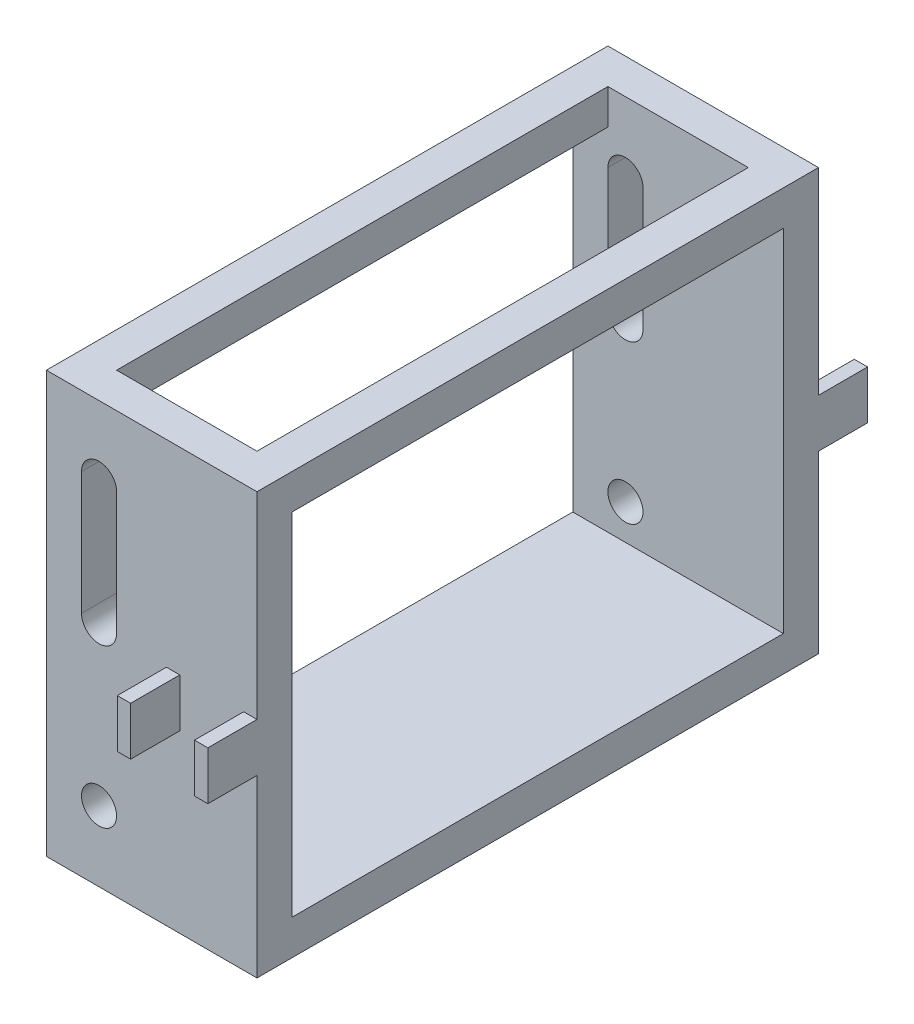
ISO-10303-21;
HEADER;
FILE_DESCRIPTION(('STEP AP214'),'2;1');
FILE_NAME('part.step','',(''),(''),'','','');
FILE_SCHEMA(('AUTOMOTIVE_DESIGN { 1 0 10303 214 1 1 1 1 }'));
ENDSEC;
DATA;
#1=APPLICATION_CONTEXT('core data for automotive mechanical design processes');
#2=APPLICATION_PROTOCOL_DEFINITION('international standard','automotive_design',2000,#1);
#3=PRODUCT_CONTEXT('',#1,'mechanical');
#4=PRODUCT('Part','Part','',(#3));
#5=PRODUCT_RELATED_PRODUCT_CATEGORY('part','',(#4));
#6=PRODUCT_DEFINITION_FORMATION('','',#4);
#7=PRODUCT_DEFINITION_CONTEXT('part definition',#1,'design');
#8=PRODUCT_DEFINITION('design','',#6,#7);
#9=PRODUCT_DEFINITION_SHAPE('','',#8);
#10=(LENGTH_UNIT() NAMED_UNIT(*) SI_UNIT(.MILLI.,.METRE.));
#11=(NAMED_UNIT(*) PLANE_ANGLE_UNIT() SI_UNIT($,.RADIAN.));
#12=(NAMED_UNIT(*) SI_UNIT($,.STERADIAN.) SOLID_ANGLE_UNIT());
#13=UNCERTAINTY_MEASURE_WITH_UNIT(LENGTH_MEASURE(1.E-05),#10,'distance_accuracy_value','');
#14=(GEOMETRIC_REPRESENTATION_CONTEXT(3) GLOBAL_UNCERTAINTY_ASSIGNED_CONTEXT((#13)) GLOBAL_UNIT_ASSIGNED_CONTEXT((#10,
#11,#12)) REPRESENTATION_CONTEXT('',''));
#15=CARTESIAN_POINT('',(0.,0.,0.));
#16=DIRECTION('',(0.,0.,1.));
#17=DIRECTION('',(1.,0.,0.));
#18=AXIS2_PLACEMENT_3D('',#15,#16,#17);
#19=CARTESIAN_POINT('',(0.,12.7,0.));
#20=DIRECTION('',(0.,0.,-1.));
#21=DIRECTION('',(-1.,0.,0.));
#22=AXIS2_PLACEMENT_3D('',#19,#20,#21);
#23=PLANE('',#22);
#24=DIRECTION('',(-1.,0.,0.));
#25=VECTOR('',#24,1.);
#26=CARTESIAN_POINT('',(71.374,81.026,0.));
#27=LINE('',#26,#25);
#28=CARTESIAN_POINT('',(76.2,81.026,0.));
#29=VERTEX_POINT('',#28);
#30=CARTESIAN_POINT('',(71.374,81.026,0.));
#31=VERTEX_POINT('',#30);
#32=EDGE_CURVE('E415',#29,#31,#27,.T.);
#33=ORIENTED_EDGE('',*,*,#32,.F.);
#34=DIRECTION('',(0.,-1.,0.));
#35=VECTOR('',#34,1.);
#36=CARTESIAN_POINT('',(76.2,12.7,0.));
#37=LINE('',#36,#35);
#38=CARTESIAN_POINT('',(76.2,152.4,0.));
#39=VERTEX_POINT('',#38);
#40=EDGE_CURVE('E655',#39,#29,#37,.T.);
#41=ORIENTED_EDGE('',*,*,#40,.F.);
#42=DIRECTION('',(1.,0.,0.));
#43=VECTOR('',#42,1.);
#44=CARTESIAN_POINT('',(0.,152.4,0.));
#45=LINE('',#44,#43);
#46=CARTESIAN_POINT('',(0.,152.4,0.));
#47=VERTEX_POINT('',#46);
#48=EDGE_CURVE('E575',#47,#39,#45,.T.);
#49=ORIENTED_EDGE('',*,*,#48,.F.);
#50=DIRECTION('',(0.,-1.,0.));
#51=VECTOR('',#50,1.);
#52=CARTESIAN_POINT('',(0.,12.7,0.));
#53=LINE('',#52,#51);
#54=CARTESIAN_POINT('',(0.,0.,0.));
#55=VERTEX_POINT('',#54);
#56=EDGE_CURVE('E659',#47,#55,#53,.T.);
#57=ORIENTED_EDGE('',*,*,#56,.T.);
#58=DIRECTION('',(1.,0.,0.));
#59=VECTOR('',#58,1.);
#60=CARTESIAN_POINT('',(0.,0.,0.));
#61=LINE('',#60,#59);
#62=CARTESIAN_POINT('',(76.2,0.,0.));
#63=VERTEX_POINT('',#62);
#64=EDGE_CURVE('E636',#55,#63,#61,.T.);
#65=ORIENTED_EDGE('',*,*,#64,.T.);
#66=CARTESIAN_POINT('',(76.2,63.5,0.));
#67=VERTEX_POINT('',#66);
#68=EDGE_CURVE('E654',#67,#63,#37,.T.);
#69=ORIENTED_EDGE('',*,*,#68,.F.);
#70=DIRECTION('',(1.,0.,0.));
#71=VECTOR('',#70,1.);
#72=CARTESIAN_POINT('',(71.374,63.5,0.));
#73=LINE('',#72,#71);
#74=CARTESIAN_POINT('',(71.374,63.5,0.));
#75=VERTEX_POINT('',#74);
#76=EDGE_CURVE('E428',#75,#67,#73,.T.);
#77=ORIENTED_EDGE('',*,*,#76,.F.);
#78=DIRECTION('',(0.,-1.,0.));
#79=VECTOR('',#78,1.);
#80=CARTESIAN_POINT('',(71.374,81.026,0.));
#81=LINE('',#80,#79);
#82=EDGE_CURVE('E409',#31,#75,#81,.T.);
#83=ORIENTED_EDGE('',*,*,#82,.F.);
#84=EDGE_LOOP('',(#33,#41,#49,#57,#65,#69,#77,#83));
#85=FACE_BOUND('',#84,.T.);
#86=CARTESIAN_POINT('',(19.05,25.4,0.));
#87=DIRECTION('',(0.,0.,1.));
#88=DIRECTION('',(1.,0.,0.));
#89=AXIS2_PLACEMENT_3D('',#86,#87,#88);
#90=CIRCLE('',#89,6.35);
#91=CARTESIAN_POINT('',(25.4,25.4,0.));
#92=VERTEX_POINT('',#91);
#93=EDGE_CURVE('E456',#92,#92,#90,.T.);
#94=ORIENTED_EDGE('',*,*,#93,.F.);
#95=EDGE_LOOP('',(#94));
#96=FACE_BOUND('',#95,.T.);
#97=DIRECTION('',(0.,-1.,0.));
#98=VECTOR('',#97,1.);
#99=CARTESIAN_POINT('',(12.7,127.,0.));
#100=LINE('',#99,#98);
#101=CARTESIAN_POINT('',(12.7,127.,0.));
#102=VERTEX_POINT('',#101);
#103=CARTESIAN_POINT('',(12.7,82.55,0.));
#104=VERTEX_POINT('',#103);
#105=EDGE_CURVE('E481',#102,#104,#100,.T.);
#106=ORIENTED_EDGE('',*,*,#105,.F.);
#107=CARTESIAN_POINT('',(19.05,127.,0.));
#108=DIRECTION('',(0.,0.,1.));
#109=DIRECTION('',(1.,0.,0.));
#110=AXIS2_PLACEMENT_3D('',#107,#108,#109);
#111=CIRCLE('',#110,6.35);
#112=CARTESIAN_POINT('',(25.4,127.,0.));
#113=VERTEX_POINT('',#112);
#114=EDGE_CURVE('E450',#113,#102,#111,.T.);
#115=ORIENTED_EDGE('',*,*,#114,.F.);
#116=DIRECTION('',(0.,1.,0.));
#117=VECTOR('',#116,1.);
#118=CARTESIAN_POINT('',(25.4,127.,0.));
#119=LINE('',#118,#117);
#120=CARTESIAN_POINT('',(25.4,82.55,0.));
#121=VERTEX_POINT('',#120);
#122=EDGE_CURVE('E466',#121,#113,#119,.T.);
#123=ORIENTED_EDGE('',*,*,#122,.F.);
#124=CARTESIAN_POINT('',(19.05,82.55,0.));
#125=DIRECTION('',(0.,0.,1.));
#126=DIRECTION('',(1.,0.,0.));
#127=AXIS2_PLACEMENT_3D('',#124,#125,#126);
#128=CIRCLE('',#127,6.35);
#129=EDGE_CURVE('E485',#104,#121,#128,.T.);
#130=ORIENTED_EDGE('',*,*,#129,.F.);
#131=EDGE_LOOP('',(#106,#115,#123,#130));
#132=FACE_BOUND('',#131,.T.);
#133=DIRECTION('',(0.,1.,0.));
#134=VECTOR('',#133,1.);
#135=CARTESIAN_POINT('',(48.26,81.026,0.));
#136=LINE('',#135,#134);
#137=CARTESIAN_POINT('',(48.26,63.5,0.));
#138=VERTEX_POINT('',#137);
#139=CARTESIAN_POINT('',(48.26,81.026,0.));
#140=VERTEX_POINT('',#139);
#141=EDGE_CURVE('E364',#138,#140,#136,.T.);
#142=ORIENTED_EDGE('',*,*,#141,.F.);
#143=DIRECTION('',(1.,0.,0.));
#144=VECTOR('',#143,1.);
#145=CARTESIAN_POINT('',(48.26,63.5,0.));
#146=LINE('',#145,#144);
#147=CARTESIAN_POINT('',(43.434,63.5,0.));
#148=VERTEX_POINT('',#147);
#149=EDGE_CURVE('E370',#148,#138,#146,.T.);
#150=ORIENTED_EDGE('',*,*,#149,.F.);
#151=DIRECTION('',(0.,-1.,0.));
#152=VECTOR('',#151,1.);
#153=CARTESIAN_POINT('',(43.434,81.026,0.));
#154=LINE('',#153,#152);
#155=CARTESIAN_POINT('',(43.434,81.026,0.));
#156=VERTEX_POINT('',#155);
#157=EDGE_CURVE('E387',#156,#148,#154,.T.);
#158=ORIENTED_EDGE('',*,*,#157,.F.);
#159=DIRECTION('',(-1.,0.,0.));
#160=VECTOR('',#159,1.);
#161=CARTESIAN_POINT('',(48.26,81.026,0.));
#162=LINE('',#161,#160);
#163=EDGE_CURVE('E383',#140,#156,#162,.T.);
#164=ORIENTED_EDGE('',*,*,#163,.F.);
#165=EDGE_LOOP('',(#142,#150,#158,#164));
#166=FACE_BOUND('',#165,.T.);
#167=ADVANCED_FACE('F39',(#85,#96,#132,#166),#23,.F.);
#168=CARTESIAN_POINT('',(0.,12.7,0.));
#169=DIRECTION('',(0.,-1.,0.));
#170=DIRECTION('',(0.,0.,-1.));
#171=AXIS2_PLACEMENT_3D('',#168,#169,#170);
#172=PLANE('',#171);
#173=DIRECTION('',(-1.,0.,0.));
#174=VECTOR('',#173,1.);
#175=CARTESIAN_POINT('',(76.2,12.7,-12.7));
#176=LINE('',#175,#174);
#177=CARTESIAN_POINT('',(76.2,12.7,-12.7));
#178=VERTEX_POINT('',#177);
#179=CARTESIAN_POINT('',(0.,12.7,-12.7));
#180=VERTEX_POINT('',#179);
#181=EDGE_CURVE('E593',#178,#180,#176,.T.);
#182=ORIENTED_EDGE('',*,*,#181,.F.);
#183=DIRECTION('',(0.,0.,-1.));
#184=VECTOR('',#183,1.);
#185=CARTESIAN_POINT('',(76.2,12.7,0.));
#186=LINE('',#185,#184);
#187=CARTESIAN_POINT('',(76.2,12.7,-190.5));
#188=VERTEX_POINT('',#187);
#189=EDGE_CURVE('E628',#178,#188,#186,.T.);
#190=ORIENTED_EDGE('',*,*,#189,.T.);
#191=DIRECTION('',(1.,0.,0.));
#192=VECTOR('',#191,1.);
#193=CARTESIAN_POINT('',(0.,12.7,-190.5));
#194=LINE('',#193,#192);
#195=CARTESIAN_POINT('',(0.,12.7,-190.5));
#196=VERTEX_POINT('',#195);
#197=EDGE_CURVE('E609',#196,#188,#194,.T.);
#198=ORIENTED_EDGE('',*,*,#197,.F.);
#199=DIRECTION('',(0.,0.,1.));
#200=VECTOR('',#199,1.);
#201=CARTESIAN_POINT('',(0.,12.7,0.));
#202=LINE('',#201,#200);
#203=EDGE_CURVE('E625',#196,#180,#202,.T.);
#204=ORIENTED_EDGE('',*,*,#203,.T.);
#205=EDGE_LOOP('',(#182,#190,#198,#204));
#206=FACE_BOUND('',#205,.T.);
#207=ADVANCED_FACE('F750',(#206),#172,.F.);
#208=CARTESIAN_POINT('',(0.,12.7,0.));
#209=DIRECTION('',(1.,0.,0.));
#210=DIRECTION('',(0.,0.,-1.));
#211=AXIS2_PLACEMENT_3D('',#208,#209,#210);
#212=PLANE('',#211);
#213=DIRECTION('',(0.,-1.,0.));
#214=VECTOR('',#213,1.);
#215=CARTESIAN_POINT('',(0.,139.7,-190.5));
#216=LINE('',#215,#214);
#217=CARTESIAN_POINT('',(0.,139.7,-190.5));
#218=VERTEX_POINT('',#217);
#219=EDGE_CURVE('E620',#218,#196,#216,.T.);
#220=ORIENTED_EDGE('',*,*,#219,.F.);
#221=DIRECTION('',(0.,0.,1.));
#222=VECTOR('',#221,1.);
#223=CARTESIAN_POINT('',(0.,139.7,-203.2));
#224=LINE('',#223,#222);
#225=CARTESIAN_POINT('',(0.,139.7,-12.7));
#226=VERTEX_POINT('',#225);
#227=EDGE_CURVE('E565',#218,#226,#224,.T.);
#228=ORIENTED_EDGE('',*,*,#227,.T.);
#229=DIRECTION('',(0.,-1.,0.));
#230=VECTOR('',#229,1.);
#231=CARTESIAN_POINT('',(0.,139.7,-12.7));
#232=LINE('',#231,#230);
#233=EDGE_CURVE('E597',#226,#180,#232,.T.);
#234=ORIENTED_EDGE('',*,*,#233,.T.);
#235=ORIENTED_EDGE('',*,*,#203,.F.);
#236=EDGE_LOOP('',(#220,#228,#234,#235));
#237=FACE_BOUND('',#236,.T.);
#238=DIRECTION('',(0.,0.,1.));
#239=VECTOR('',#238,1.);
#240=CARTESIAN_POINT('',(0.,0.,0.));
#241=LINE('',#240,#239);
#242=CARTESIAN_POINT('',(0.,0.,-203.2));
#243=VERTEX_POINT('',#242);
#244=EDGE_CURVE('E624',#243,#55,#241,.T.);
#245=ORIENTED_EDGE('',*,*,#244,.T.);
#246=ORIENTED_EDGE('',*,*,#56,.F.);
#247=DIRECTION('',(0.,0.,1.));
#248=VECTOR('',#247,1.);
#249=CARTESIAN_POINT('',(0.,152.4,-203.2));
#250=LINE('',#249,#248);
#251=CARTESIAN_POINT('',(0.,152.4,-203.2));
#252=VERTEX_POINT('',#251);
#253=EDGE_CURVE('E570',#252,#47,#250,.T.);
#254=ORIENTED_EDGE('',*,*,#253,.F.);
#255=DIRECTION('',(0.,-1.,0.));
#256=VECTOR('',#255,1.);
#257=CARTESIAN_POINT('',(0.,12.7,-203.2));
#258=LINE('',#257,#256);
#259=EDGE_CURVE('E632',#252,#243,#258,.T.);
#260=ORIENTED_EDGE('',*,*,#259,.T.);
#261=EDGE_LOOP('',(#245,#246,#254,#260));
#262=FACE_BOUND('',#261,.T.);
#263=ADVANCED_FACE('F41',(#237,#262),#212,.F.);
#264=CARTESIAN_POINT('',(76.2,12.7,0.));
#265=DIRECTION('',(-1.,0.,0.));
#266=DIRECTION('',(0.,0.,1.));
#267=AXIS2_PLACEMENT_3D('',#264,#265,#266);
#268=PLANE('',#267);
#269=DIRECTION('',(0.,-1.,0.));
#270=VECTOR('',#269,1.);
#271=CARTESIAN_POINT('',(76.2,12.7,-203.2));
#272=LINE('',#271,#270);
#273=CARTESIAN_POINT('',(76.2,152.4,-203.2));
#274=VERTEX_POINT('',#273);
#275=CARTESIAN_POINT('',(76.2,81.026,-203.2));
#276=VERTEX_POINT('',#275);
#277=EDGE_CURVE('E650',#274,#276,#272,.T.);
#278=ORIENTED_EDGE('',*,*,#277,.F.);
#279=DIRECTION('',(0.,0.,-1.));
#280=VECTOR('',#279,1.);
#281=CARTESIAN_POINT('',(76.2,152.4,0.));
#282=LINE('',#281,#280);
#283=EDGE_CURVE('E579',#39,#274,#282,.T.);
#284=ORIENTED_EDGE('',*,*,#283,.F.);
#285=ORIENTED_EDGE('',*,*,#40,.T.);
#286=DIRECTION('',(0.,0.,-1.));
#287=VECTOR('',#286,1.);
#288=CARTESIAN_POINT('',(76.2,81.026,17.78));
#289=LINE('',#288,#287);
#290=CARTESIAN_POINT('',(76.2,81.026,17.78));
#291=VERTEX_POINT('',#290);
#292=EDGE_CURVE('E438',#291,#29,#289,.T.);
#293=ORIENTED_EDGE('',*,*,#292,.F.);
#294=DIRECTION('',(0.,1.,0.));
#295=VECTOR('',#294,1.);
#296=CARTESIAN_POINT('',(76.2,81.026,17.78));
#297=LINE('',#296,#295);
#298=CARTESIAN_POINT('',(76.2,63.5,17.78));
#299=VERTEX_POINT('',#298);
#300=EDGE_CURVE('E418',#299,#291,#297,.T.);
#301=ORIENTED_EDGE('',*,*,#300,.F.);
#302=DIRECTION('',(0.,0.,-1.));
#303=VECTOR('',#302,1.);
#304=CARTESIAN_POINT('',(76.2,63.5,17.78));
#305=LINE('',#304,#303);
#306=EDGE_CURVE('E442',#299,#67,#305,.T.);
#307=ORIENTED_EDGE('',*,*,#306,.T.);
#308=ORIENTED_EDGE('',*,*,#68,.T.);
#309=DIRECTION('',(0.,0.,-1.));
#310=VECTOR('',#309,1.);
#311=CARTESIAN_POINT('',(76.2,0.,0.));
#312=LINE('',#311,#310);
#313=CARTESIAN_POINT('',(76.2,0.,-203.2));
#314=VERTEX_POINT('',#313);
#315=EDGE_CURVE('E640',#63,#314,#312,.T.);
#316=ORIENTED_EDGE('',*,*,#315,.T.);
#317=CARTESIAN_POINT('',(76.2,63.5,-203.2));
#318=VERTEX_POINT('',#317);
#319=EDGE_CURVE('E649',#318,#314,#272,.T.);
#320=ORIENTED_EDGE('',*,*,#319,.F.);
#321=DIRECTION('',(0.,0.,1.));
#322=VECTOR('',#321,1.);
#323=CARTESIAN_POINT('',(76.2,63.5,-220.98));
#324=LINE('',#323,#322);
#325=CARTESIAN_POINT('',(76.2,63.5,-220.98));
#326=VERTEX_POINT('',#325);
#327=EDGE_CURVE('E355',#326,#318,#324,.T.);
#328=ORIENTED_EDGE('',*,*,#327,.F.);
#329=DIRECTION('',(0.,1.,0.));
#330=VECTOR('',#329,1.);
#331=CARTESIAN_POINT('',(76.2,81.026,-220.98));
#332=LINE('',#331,#330);
#333=CARTESIAN_POINT('',(76.2,81.026,-220.98));
#334=VERTEX_POINT('',#333);
#335=EDGE_CURVE('E335',#326,#334,#332,.T.);
#336=ORIENTED_EDGE('',*,*,#335,.T.);
#337=DIRECTION('',(0.,0.,1.));
#338=VECTOR('',#337,1.);
#339=CARTESIAN_POINT('',(76.2,81.026,-220.98));
#340=LINE('',#339,#338);
#341=EDGE_CURVE('E358',#334,#276,#340,.T.);
#342=ORIENTED_EDGE('',*,*,#341,.T.);
#343=EDGE_LOOP('',(#278,#284,#285,#293,#301,#307,#308,#316,#320,#328,#336,#342));
#344=FACE_BOUND('',#343,.T.);
#345=DIRECTION('',(0.,0.,-1.));
#346=VECTOR('',#345,1.);
#347=CARTESIAN_POINT('',(76.2,139.7,0.));
#348=LINE('',#347,#346);
#349=CARTESIAN_POINT('',(76.2,139.7,-12.7));
#350=VERTEX_POINT('',#349);
#351=CARTESIAN_POINT('',(76.2,139.7,-190.5));
#352=VERTEX_POINT('',#351);
#353=EDGE_CURVE('E571',#350,#352,#348,.T.);
#354=ORIENTED_EDGE('',*,*,#353,.T.);
#355=DIRECTION('',(0.,-1.,0.));
#356=VECTOR('',#355,1.);
#357=CARTESIAN_POINT('',(76.2,139.7,-190.5));
#358=LINE('',#357,#356);
#359=EDGE_CURVE('E613',#352,#188,#358,.T.);
#360=ORIENTED_EDGE('',*,*,#359,.T.);
#361=ORIENTED_EDGE('',*,*,#189,.F.);
#362=DIRECTION('',(0.,-1.,0.));
#363=VECTOR('',#362,1.);
#364=CARTESIAN_POINT('',(76.2,139.7,-12.7));
#365=LINE('',#364,#363);
#366=EDGE_CURVE('E605',#350,#178,#365,.T.);
#367=ORIENTED_EDGE('',*,*,#366,.F.);
#368=EDGE_LOOP('',(#354,#360,#361,#367));
#369=FACE_BOUND('',#368,.T.);
#370=ADVANCED_FACE('F706',(#344,#369),#268,.F.);
#371=CARTESIAN_POINT('',(0.,12.7,-203.2));
#372=DIRECTION('',(0.,0.,1.));
#373=DIRECTION('',(1.,0.,0.));
#374=AXIS2_PLACEMENT_3D('',#371,#372,#373);
#375=PLANE('',#374);
#376=DIRECTION('',(1.,0.,0.));
#377=VECTOR('',#376,1.);
#378=CARTESIAN_POINT('',(48.26,63.5,-203.2));
#379=LINE('',#378,#377);
#380=CARTESIAN_POINT('',(43.434,63.5,-203.2));
#381=VERTEX_POINT('',#380);
#382=CARTESIAN_POINT('',(48.26,63.5,-203.2));
#383=VERTEX_POINT('',#382);
#384=EDGE_CURVE('E311',#381,#383,#379,.T.);
#385=ORIENTED_EDGE('',*,*,#384,.T.);
#386=DIRECTION('',(0.,1.,0.));
#387=VECTOR('',#386,1.);
#388=CARTESIAN_POINT('',(48.26,81.026,-203.2));
#389=LINE('',#388,#387);
#390=CARTESIAN_POINT('',(48.26,81.026,-203.2));
#391=VERTEX_POINT('',#390);
#392=EDGE_CURVE('E280',#383,#391,#389,.T.);
#393=ORIENTED_EDGE('',*,*,#392,.T.);
#394=DIRECTION('',(-1.,0.,0.));
#395=VECTOR('',#394,1.);
#396=CARTESIAN_POINT('',(48.26,81.026,-203.2));
#397=LINE('',#396,#395);
#398=CARTESIAN_POINT('',(43.434,81.026,-203.2));
#399=VERTEX_POINT('',#398);
#400=EDGE_CURVE('E297',#391,#399,#397,.T.);
#401=ORIENTED_EDGE('',*,*,#400,.T.);
#402=DIRECTION('',(0.,-1.,0.));
#403=VECTOR('',#402,1.);
#404=CARTESIAN_POINT('',(43.434,81.026,-203.2));
#405=LINE('',#404,#403);
#406=EDGE_CURVE('E56',#399,#381,#405,.T.);
#407=ORIENTED_EDGE('',*,*,#406,.T.);
#408=EDGE_LOOP('',(#385,#393,#401,#407));
#409=FACE_BOUND('',#408,.T.);
#410=CARTESIAN_POINT('',(19.05,25.4,-203.2));
#411=DIRECTION('',(0.,0.,1.));
#412=DIRECTION('',(1.,0.,0.));
#413=AXIS2_PLACEMENT_3D('',#410,#411,#412);
#414=CIRCLE('',#413,6.35);
#415=CARTESIAN_POINT('',(25.4,25.4,-203.2));
#416=VERTEX_POINT('',#415);
#417=EDGE_CURVE('E451',#416,#416,#414,.T.);
#418=ORIENTED_EDGE('',*,*,#417,.T.);
#419=EDGE_LOOP('',(#418));
#420=FACE_BOUND('',#419,.T.);
#421=DIRECTION('',(0.,1.,0.));
#422=VECTOR('',#421,1.);
#423=CARTESIAN_POINT('',(25.4,127.,-203.2));
#424=LINE('',#423,#422);
#425=CARTESIAN_POINT('',(25.4,82.55,-203.2));
#426=VERTEX_POINT('',#425);
#427=CARTESIAN_POINT('',(25.4,127.,-203.2));
#428=VERTEX_POINT('',#427);
#429=EDGE_CURVE('E474',#426,#428,#424,.T.);
#430=ORIENTED_EDGE('',*,*,#429,.T.);
#431=CARTESIAN_POINT('',(19.05,127.,-203.2));
#432=DIRECTION('',(0.,0.,1.));
#433=DIRECTION('',(1.,0.,0.));
#434=AXIS2_PLACEMENT_3D('',#431,#432,#433);
#435=CIRCLE('',#434,6.35);
#436=CARTESIAN_POINT('',(12.7,127.,-203.2));
#437=VERTEX_POINT('',#436);
#438=EDGE_CURVE('E461',#428,#437,#435,.T.);
#439=ORIENTED_EDGE('',*,*,#438,.T.);
#440=DIRECTION('',(0.,-1.,0.));
#441=VECTOR('',#440,1.);
#442=CARTESIAN_POINT('',(12.7,127.,-203.2));
#443=LINE('',#442,#441);
#444=CARTESIAN_POINT('',(12.7,82.55,-203.2));
#445=VERTEX_POINT('',#444);
#446=EDGE_CURVE('E465',#437,#445,#443,.T.);
#447=ORIENTED_EDGE('',*,*,#446,.T.);
#448=CARTESIAN_POINT('',(19.05,82.55,-203.2));
#449=DIRECTION('',(0.,0.,1.));
#450=DIRECTION('',(1.,0.,0.));
#451=AXIS2_PLACEMENT_3D('',#448,#449,#450);
#452=CIRCLE('',#451,6.35);
#453=EDGE_CURVE('E470',#445,#426,#452,.T.);
#454=ORIENTED_EDGE('',*,*,#453,.T.);
#455=EDGE_LOOP('',(#430,#439,#447,#454));
#456=FACE_BOUND('',#455,.T.);
#457=DIRECTION('',(0.,-1.,0.));
#458=VECTOR('',#457,1.);
#459=CARTESIAN_POINT('',(71.374,81.026,-203.2));
#460=LINE('',#459,#458);
#461=CARTESIAN_POINT('',(71.374,81.026,-203.2));
#462=VERTEX_POINT('',#461);
#463=CARTESIAN_POINT('',(71.374,63.5,-203.2));
#464=VERTEX_POINT('',#463);
#465=EDGE_CURVE('E64',#462,#464,#460,.T.);
#466=ORIENTED_EDGE('',*,*,#465,.T.);
#467=DIRECTION('',(1.,0.,0.));
#468=VECTOR('',#467,1.);
#469=CARTESIAN_POINT('',(71.374,63.5,-203.2));
#470=LINE('',#469,#468);
#471=EDGE_CURVE('E331',#464,#318,#470,.T.);
#472=ORIENTED_EDGE('',*,*,#471,.T.);
#473=ORIENTED_EDGE('',*,*,#319,.T.);
#474=DIRECTION('',(-1.,0.,0.));
#475=VECTOR('',#474,1.);
#476=CARTESIAN_POINT('',(0.,0.,-203.2));
#477=LINE('',#476,#475);
#478=EDGE_CURVE('E629',#314,#243,#477,.T.);
#479=ORIENTED_EDGE('',*,*,#478,.T.);
#480=ORIENTED_EDGE('',*,*,#259,.F.);
#481=DIRECTION('',(-1.,0.,0.));
#482=VECTOR('',#481,1.);
#483=CARTESIAN_POINT('',(76.2,152.4,-203.2));
#484=LINE('',#483,#482);
#485=EDGE_CURVE('E566',#274,#252,#484,.T.);
#486=ORIENTED_EDGE('',*,*,#485,.F.);
#487=ORIENTED_EDGE('',*,*,#277,.T.);
#488=DIRECTION('',(-1.,0.,0.));
#489=VECTOR('',#488,1.);
#490=CARTESIAN_POINT('',(71.374,81.026,-203.2));
#491=LINE('',#490,#489);
#492=EDGE_CURVE('E346',#276,#462,#491,.T.);
#493=ORIENTED_EDGE('',*,*,#492,.T.);
#494=EDGE_LOOP('',(#466,#472,#473,#479,#480,#486,#487,#493));
#495=FACE_BOUND('',#494,.T.);
#496=ADVANCED_FACE('F720',(#409,#420,#456,#495),#375,.F.);
#497=CARTESIAN_POINT('',(0.,0.,0.));
#498=DIRECTION('',(0.,-1.,0.));
#499=DIRECTION('',(0.,0.,-1.));
#500=AXIS2_PLACEMENT_3D('',#497,#498,#499);
#501=PLANE('',#500);
#502=ORIENTED_EDGE('',*,*,#244,.F.);
#503=ORIENTED_EDGE('',*,*,#478,.F.);
#504=ORIENTED_EDGE('',*,*,#315,.F.);
#505=ORIENTED_EDGE('',*,*,#64,.F.);
#506=EDGE_LOOP('',(#502,#503,#504,#505));
#507=FACE_BOUND('',#506,.T.);
#508=ADVANCED_FACE('F718',(#507),#501,.T.);
#509=CARTESIAN_POINT('',(0.,139.7,-190.5));
#510=DIRECTION('',(0.,0.,-1.));
#511=DIRECTION('',(-1.,0.,0.));
#512=AXIS2_PLACEMENT_3D('',#509,#510,#511);
#513=PLANE('',#512);
#514=CARTESIAN_POINT('',(19.05,25.4,-190.5));
#515=DIRECTION('',(0.,0.,-1.));
#516=DIRECTION('',(-1.,0.,0.));
#517=AXIS2_PLACEMENT_3D('',#514,#515,#516);
#518=CIRCLE('',#517,6.35);
#519=CARTESIAN_POINT('',(12.7,25.4,-190.5));
#520=VERTEX_POINT('',#519);
#521=EDGE_CURVE('E524',#520,#520,#518,.T.);
#522=ORIENTED_EDGE('',*,*,#521,.T.);
#523=EDGE_LOOP('',(#522));
#524=FACE_BOUND('',#523,.T.);
#525=DIRECTION('',(0.,1.,0.));
#526=VECTOR('',#525,1.);
#527=CARTESIAN_POINT('',(12.7,139.7,-190.5));
#528=LINE('',#527,#526);
#529=CARTESIAN_POINT('',(12.7,82.55,-190.5));
#530=VERTEX_POINT('',#529);
#531=CARTESIAN_POINT('',(12.7,127.,-190.5));
#532=VERTEX_POINT('',#531);
#533=EDGE_CURVE('E455',#530,#532,#528,.T.);
#534=ORIENTED_EDGE('',*,*,#533,.T.);
#535=CARTESIAN_POINT('',(19.05,127.,-190.5));
#536=DIRECTION('',(0.,0.,-1.));
#537=DIRECTION('',(-1.,0.,0.));
#538=AXIS2_PLACEMENT_3D('',#535,#536,#537);
#539=CIRCLE('',#538,6.35);
#540=CARTESIAN_POINT('',(25.4,127.,-190.5));
#541=VERTEX_POINT('',#540);
#542=EDGE_CURVE('E520',#532,#541,#539,.T.);
#543=ORIENTED_EDGE('',*,*,#542,.T.);
#544=DIRECTION('',(0.,-1.,0.));
#545=VECTOR('',#544,1.);
#546=CARTESIAN_POINT('',(25.4,139.7,-190.5));
#547=LINE('',#546,#545);
#548=CARTESIAN_POINT('',(25.4,82.55,-190.5));
#549=VERTEX_POINT('',#548);
#550=EDGE_CURVE('E516',#541,#549,#547,.T.);
#551=ORIENTED_EDGE('',*,*,#550,.T.);
#552=CARTESIAN_POINT('',(19.05,82.55,-190.5));
#553=DIRECTION('',(0.,0.,-1.));
#554=DIRECTION('',(-1.,0.,0.));
#555=AXIS2_PLACEMENT_3D('',#552,#553,#554);
#556=CIRCLE('',#555,6.35);
#557=EDGE_CURVE('E512',#549,#530,#556,.T.);
#558=ORIENTED_EDGE('',*,*,#557,.T.);
#559=EDGE_LOOP('',(#534,#543,#551,#558));
#560=FACE_BOUND('',#559,.T.);
#561=ORIENTED_EDGE('',*,*,#197,.T.);
#562=ORIENTED_EDGE('',*,*,#359,.F.);
#563=DIRECTION('',(1.,0.,0.));
#564=VECTOR('',#563,1.);
#565=CARTESIAN_POINT('',(0.,139.7,-190.5));
#566=LINE('',#565,#564);
#567=CARTESIAN_POINT('',(63.5,139.7,-190.5));
#568=VERTEX_POINT('',#567);
#569=EDGE_CURVE('E583',#568,#352,#566,.T.);
#570=ORIENTED_EDGE('',*,*,#569,.F.);
#571=DIRECTION('',(0.,-1.,0.));
#572=VECTOR('',#571,1.);
#573=CARTESIAN_POINT('',(63.5,152.4,-190.5));
#574=LINE('',#573,#572);
#575=CARTESIAN_POINT('',(63.5,152.4,-190.5));
#576=VERTEX_POINT('',#575);
#577=EDGE_CURVE('E553',#576,#568,#574,.T.);
#578=ORIENTED_EDGE('',*,*,#577,.F.);
#579=DIRECTION('',(-1.,0.,0.));
#580=VECTOR('',#579,1.);
#581=CARTESIAN_POINT('',(12.7,152.4,-190.5));
#582=LINE('',#581,#580);
#583=CARTESIAN_POINT('',(12.7,152.4,-190.5));
#584=VERTEX_POINT('',#583);
#585=EDGE_CURVE('E540',#576,#584,#582,.T.);
#586=ORIENTED_EDGE('',*,*,#585,.T.);
#587=DIRECTION('',(0.,-1.,0.));
#588=VECTOR('',#587,1.);
#589=CARTESIAN_POINT('',(12.7,152.4,-190.5));
#590=LINE('',#589,#588);
#591=CARTESIAN_POINT('',(12.7,139.7,-190.5));
#592=VERTEX_POINT('',#591);
#593=EDGE_CURVE('E543',#584,#592,#590,.T.);
#594=ORIENTED_EDGE('',*,*,#593,.T.);
#595=DIRECTION('',(1.,0.,0.));
#596=VECTOR('',#595,1.);
#597=CARTESIAN_POINT('',(0.,139.7,-190.5));
#598=LINE('',#597,#596);
#599=EDGE_CURVE('E610',#218,#592,#598,.T.);
#600=ORIENTED_EDGE('',*,*,#599,.F.);
#601=ORIENTED_EDGE('',*,*,#219,.T.);
#602=EDGE_LOOP('',(#561,#562,#570,#578,#586,#594,#600,#601));
#603=FACE_BOUND('',#602,.T.);
#604=ADVANCED_FACE('F765',(#524,#560,#603),#513,.F.);
#605=CARTESIAN_POINT('',(76.2,139.7,-12.7));
#606=DIRECTION('',(0.,0.,1.));
#607=DIRECTION('',(1.,0.,0.));
#608=AXIS2_PLACEMENT_3D('',#605,#606,#607);
#609=PLANE('',#608);
#610=CARTESIAN_POINT('',(19.05,25.4,-12.7));
#611=DIRECTION('',(0.,0.,1.));
#612=DIRECTION('',(1.,0.,0.));
#613=AXIS2_PLACEMENT_3D('',#610,#611,#612);
#614=CIRCLE('',#613,6.35);
#615=CARTESIAN_POINT('',(25.4,25.4,-12.7));
#616=VERTEX_POINT('',#615);
#617=EDGE_CURVE('E43',#616,#616,#614,.T.);
#618=ORIENTED_EDGE('',*,*,#617,.T.);
#619=EDGE_LOOP('',(#618));
#620=FACE_BOUND('',#619,.T.);
#621=DIRECTION('',(0.,1.,0.));
#622=VECTOR('',#621,1.);
#623=CARTESIAN_POINT('',(25.4,139.7,-12.7));
#624=LINE('',#623,#622);
#625=CARTESIAN_POINT('',(25.4,82.55,-12.7));
#626=VERTEX_POINT('',#625);
#627=CARTESIAN_POINT('',(25.4,127.,-12.7));
#628=VERTEX_POINT('',#627);
#629=EDGE_CURVE('E49',#626,#628,#624,.T.);
#630=ORIENTED_EDGE('',*,*,#629,.T.);
#631=CARTESIAN_POINT('',(19.05,127.,-12.7));
#632=DIRECTION('',(0.,0.,1.));
#633=DIRECTION('',(1.,0.,0.));
#634=AXIS2_PLACEMENT_3D('',#631,#632,#633);
#635=CIRCLE('',#634,6.35);
#636=CARTESIAN_POINT('',(12.7,127.,-12.7));
#637=VERTEX_POINT('',#636);
#638=EDGE_CURVE('E11',#628,#637,#635,.T.);
#639=ORIENTED_EDGE('',*,*,#638,.T.);
#640=DIRECTION('',(0.,-1.,0.));
#641=VECTOR('',#640,1.);
#642=CARTESIAN_POINT('',(12.7,139.7,-12.7));
#643=LINE('',#642,#641);
#644=CARTESIAN_POINT('',(12.7,82.55,-12.7));
#645=VERTEX_POINT('',#644);
#646=EDGE_CURVE('E663',#637,#645,#643,.T.);
#647=ORIENTED_EDGE('',*,*,#646,.T.);
#648=CARTESIAN_POINT('',(19.05,82.55,-12.7));
#649=DIRECTION('',(0.,0.,1.));
#650=DIRECTION('',(1.,0.,0.));
#651=AXIS2_PLACEMENT_3D('',#648,#649,#650);
#652=CIRCLE('',#651,6.35);
#653=EDGE_CURVE('E667',#645,#626,#652,.T.);
#654=ORIENTED_EDGE('',*,*,#653,.T.);
#655=EDGE_LOOP('',(#630,#639,#647,#654));
#656=FACE_BOUND('',#655,.T.);
#657=ORIENTED_EDGE('',*,*,#181,.T.);
#658=ORIENTED_EDGE('',*,*,#233,.F.);
#659=DIRECTION('',(-1.,0.,0.));
#660=VECTOR('',#659,1.);
#661=CARTESIAN_POINT('',(76.2,139.7,-12.7));
#662=LINE('',#661,#660);
#663=CARTESIAN_POINT('',(12.7,139.7,-12.7));
#664=VERTEX_POINT('',#663);
#665=EDGE_CURVE('E598',#664,#226,#662,.T.);
#666=ORIENTED_EDGE('',*,*,#665,.F.);
#667=DIRECTION('',(0.,-1.,0.));
#668=VECTOR('',#667,1.);
#669=CARTESIAN_POINT('',(12.7,152.4,-12.7));
#670=LINE('',#669,#668);
#671=CARTESIAN_POINT('',(12.7,152.4,-12.7));
#672=VERTEX_POINT('',#671);
#673=EDGE_CURVE('E561',#672,#664,#670,.T.);
#674=ORIENTED_EDGE('',*,*,#673,.F.);
#675=DIRECTION('',(1.,0.,0.));
#676=VECTOR('',#675,1.);
#677=CARTESIAN_POINT('',(12.7,152.4,-12.7));
#678=LINE('',#677,#676);
#679=CARTESIAN_POINT('',(63.5,152.4,-12.7));
#680=VERTEX_POINT('',#679);
#681=EDGE_CURVE('E532',#672,#680,#678,.T.);
#682=ORIENTED_EDGE('',*,*,#681,.T.);
#683=DIRECTION('',(0.,-1.,0.));
#684=VECTOR('',#683,1.);
#685=CARTESIAN_POINT('',(63.5,152.4,-12.7));
#686=LINE('',#685,#684);
#687=CARTESIAN_POINT('',(63.5,139.7,-12.7));
#688=VERTEX_POINT('',#687);
#689=EDGE_CURVE('E557',#680,#688,#686,.T.);
#690=ORIENTED_EDGE('',*,*,#689,.T.);
#691=EDGE_CURVE('E594',#350,#688,#662,.T.);
#692=ORIENTED_EDGE('',*,*,#691,.F.);
#693=ORIENTED_EDGE('',*,*,#366,.T.);
#694=EDGE_LOOP('',(#657,#658,#666,#674,#682,#690,#692,#693));
#695=FACE_BOUND('',#694,.T.);
#696=ADVANCED_FACE('F674',(#620,#656,#695),#609,.F.);
#697=CARTESIAN_POINT('',(0.,139.7,0.));
#698=DIRECTION('',(0.,1.,0.));
#699=DIRECTION('',(0.,0.,1.));
#700=AXIS2_PLACEMENT_3D('',#697,#698,#699);
#701=PLANE('',#700);
#702=ORIENTED_EDGE('',*,*,#227,.F.);
#703=ORIENTED_EDGE('',*,*,#599,.T.);
#704=DIRECTION('',(0.,0.,1.));
#705=VECTOR('',#704,1.);
#706=CARTESIAN_POINT('',(12.7,139.7,-190.5));
#707=LINE('',#706,#705);
#708=EDGE_CURVE('E528',#592,#664,#707,.T.);
#709=ORIENTED_EDGE('',*,*,#708,.T.);
#710=ORIENTED_EDGE('',*,*,#665,.T.);
#711=EDGE_LOOP('',(#702,#703,#709,#710));
#712=FACE_BOUND('',#711,.T.);
#713=ADVANCED_FACE('F772',(#712),#701,.F.);
#714=DIRECTION('',(0.,0.,-1.));
#715=VECTOR('',#714,1.);
#716=CARTESIAN_POINT('',(63.5,139.7,-190.5));
#717=LINE('',#716,#715);
#718=EDGE_CURVE('E533',#688,#568,#717,.T.);
#719=ORIENTED_EDGE('',*,*,#718,.T.);
#720=ORIENTED_EDGE('',*,*,#569,.T.);
#721=ORIENTED_EDGE('',*,*,#353,.F.);
#722=ORIENTED_EDGE('',*,*,#691,.T.);
#723=EDGE_LOOP('',(#719,#720,#721,#722));
#724=FACE_BOUND('',#723,.T.);
#725=ADVANCED_FACE('F776',(#724),#701,.F.);
#726=CARTESIAN_POINT('',(0.,152.4,0.));
#727=DIRECTION('',(0.,1.,0.));
#728=DIRECTION('',(0.,0.,1.));
#729=AXIS2_PLACEMENT_3D('',#726,#727,#728);
#730=PLANE('',#729);
#731=ORIENTED_EDGE('',*,*,#485,.T.);
#732=ORIENTED_EDGE('',*,*,#253,.T.);
#733=ORIENTED_EDGE('',*,*,#48,.T.);
#734=ORIENTED_EDGE('',*,*,#283,.T.);
#735=EDGE_LOOP('',(#731,#732,#733,#734));
#736=FACE_BOUND('',#735,.T.);
#737=ORIENTED_EDGE('',*,*,#681,.F.);
#738=DIRECTION('',(0.,0.,1.));
#739=VECTOR('',#738,1.);
#740=CARTESIAN_POINT('',(12.7,152.4,-190.5));
#741=LINE('',#740,#739);
#742=EDGE_CURVE('E529',#584,#672,#741,.T.);
#743=ORIENTED_EDGE('',*,*,#742,.F.);
#744=ORIENTED_EDGE('',*,*,#585,.F.);
#745=DIRECTION('',(0.,0.,-1.));
#746=VECTOR('',#745,1.);
#747=CARTESIAN_POINT('',(63.5,152.4,-190.5));
#748=LINE('',#747,#746);
#749=EDGE_CURVE('E536',#680,#576,#748,.T.);
#750=ORIENTED_EDGE('',*,*,#749,.F.);
#751=EDGE_LOOP('',(#737,#743,#744,#750));
#752=FACE_BOUND('',#751,.T.);
#753=ADVANCED_FACE('F725',(#736,#752),#730,.T.);
#754=CARTESIAN_POINT('',(12.7,152.4,-190.5));
#755=DIRECTION('',(1.,0.,0.));
#756=DIRECTION('',(0.,0.,-1.));
#757=AXIS2_PLACEMENT_3D('',#754,#755,#756);
#758=PLANE('',#757);
#759=ORIENTED_EDGE('',*,*,#708,.F.);
#760=ORIENTED_EDGE('',*,*,#593,.F.);
#761=ORIENTED_EDGE('',*,*,#742,.T.);
#762=ORIENTED_EDGE('',*,*,#673,.T.);
#763=EDGE_LOOP('',(#759,#760,#761,#762));
#764=FACE_BOUND('',#763,.T.);
#765=ADVANCED_FACE('F780',(#764),#758,.T.);
#766=CARTESIAN_POINT('',(63.5,152.4,-190.5));
#767=DIRECTION('',(-1.,0.,0.));
#768=DIRECTION('',(0.,0.,1.));
#769=AXIS2_PLACEMENT_3D('',#766,#767,#768);
#770=PLANE('',#769);
#771=ORIENTED_EDGE('',*,*,#718,.F.);
#772=ORIENTED_EDGE('',*,*,#689,.F.);
#773=ORIENTED_EDGE('',*,*,#749,.T.);
#774=ORIENTED_EDGE('',*,*,#577,.T.);
#775=EDGE_LOOP('',(#771,#772,#773,#774));
#776=FACE_BOUND('',#775,.T.);
#777=ADVANCED_FACE('F783',(#776),#770,.T.);
#778=CARTESIAN_POINT('',(12.7,127.,-203.2));
#779=DIRECTION('',(-1.,0.,0.));
#780=DIRECTION('',(0.,0.,1.));
#781=AXIS2_PLACEMENT_3D('',#778,#779,#780);
#782=PLANE('',#781);
#783=DIRECTION('',(0.,0.,1.));
#784=VECTOR('',#783,1.);
#785=CARTESIAN_POINT('',(12.7,127.,-203.2));
#786=LINE('',#785,#784);
#787=EDGE_CURVE('E478',#637,#102,#786,.T.);
#788=ORIENTED_EDGE('',*,*,#787,.T.);
#789=ORIENTED_EDGE('',*,*,#105,.T.);
#790=DIRECTION('',(0.,0.,1.));
#791=VECTOR('',#790,1.);
#792=CARTESIAN_POINT('',(12.7,82.55,-203.2));
#793=LINE('',#792,#791);
#794=EDGE_CURVE('E505',#645,#104,#793,.T.);
#795=ORIENTED_EDGE('',*,*,#794,.F.);
#796=ORIENTED_EDGE('',*,*,#646,.F.);
#797=EDGE_LOOP('',(#788,#789,#795,#796));
#798=FACE_BOUND('',#797,.T.);
#799=ADVANCED_FACE('F693',(#798),#782,.F.);
#800=CARTESIAN_POINT('',(19.05,82.55,-203.2));
#801=DIRECTION('',(0.,0.,1.));
#802=DIRECTION('',(1.,0.,0.));
#803=AXIS2_PLACEMENT_3D('',#800,#801,#802);
#804=CYLINDRICAL_SURFACE('',#803,6.35);
#805=ORIENTED_EDGE('',*,*,#794,.T.);
#806=ORIENTED_EDGE('',*,*,#129,.T.);
#807=DIRECTION('',(0.,0.,1.));
#808=VECTOR('',#807,1.);
#809=CARTESIAN_POINT('',(25.4,82.55,-203.2));
#810=LINE('',#809,#808);
#811=EDGE_CURVE('E500',#626,#121,#810,.T.);
#812=ORIENTED_EDGE('',*,*,#811,.F.);
#813=ORIENTED_EDGE('',*,*,#653,.F.);
#814=EDGE_LOOP('',(#805,#806,#812,#813));
#815=FACE_BOUND('',#814,.T.);
#816=ADVANCED_FACE('F682',(#815),#804,.F.);
#817=CARTESIAN_POINT('',(25.4,127.,-203.2));
#818=DIRECTION('',(1.,0.,0.));
#819=DIRECTION('',(0.,0.,-1.));
#820=AXIS2_PLACEMENT_3D('',#817,#818,#819);
#821=PLANE('',#820);
#822=ORIENTED_EDGE('',*,*,#811,.T.);
#823=ORIENTED_EDGE('',*,*,#122,.T.);
#824=DIRECTION('',(0.,0.,1.));
#825=VECTOR('',#824,1.);
#826=CARTESIAN_POINT('',(25.4,127.,-203.2));
#827=LINE('',#826,#825);
#828=EDGE_CURVE('E495',#628,#113,#827,.T.);
#829=ORIENTED_EDGE('',*,*,#828,.F.);
#830=ORIENTED_EDGE('',*,*,#629,.F.);
#831=EDGE_LOOP('',(#822,#823,#829,#830));
#832=FACE_BOUND('',#831,.T.);
#833=ADVANCED_FACE('F680',(#832),#821,.F.);
#834=CARTESIAN_POINT('',(19.05,127.,-203.2));
#835=DIRECTION('',(0.,0.,1.));
#836=DIRECTION('',(1.,0.,0.));
#837=AXIS2_PLACEMENT_3D('',#834,#835,#836);
#838=CYLINDRICAL_SURFACE('',#837,6.35);
#839=ORIENTED_EDGE('',*,*,#828,.T.);
#840=ORIENTED_EDGE('',*,*,#114,.T.);
#841=ORIENTED_EDGE('',*,*,#787,.F.);
#842=ORIENTED_EDGE('',*,*,#638,.F.);
#843=EDGE_LOOP('',(#839,#840,#841,#842));
#844=FACE_BOUND('',#843,.T.);
#845=ADVANCED_FACE('F698',(#844),#838,.F.);
#846=CARTESIAN_POINT('',(19.05,25.4,-203.2));
#847=DIRECTION('',(0.,0.,1.));
#848=DIRECTION('',(1.,0.,0.));
#849=AXIS2_PLACEMENT_3D('',#846,#847,#848);
#850=CYLINDRICAL_SURFACE('',#849,6.35);
#851=ORIENTED_EDGE('',*,*,#93,.T.);
#852=EDGE_LOOP('',(#851));
#853=FACE_BOUND('',#852,.T.);
#854=ORIENTED_EDGE('',*,*,#617,.F.);
#855=EDGE_LOOP('',(#854));
#856=FACE_BOUND('',#855,.T.);
#857=ADVANCED_FACE('F792',(#853,#856),#850,.F.);
#858=EDGE_CURVE('E506',#437,#532,#786,.T.);
#859=ORIENTED_EDGE('',*,*,#858,.F.);
#860=ORIENTED_EDGE('',*,*,#438,.F.);
#861=EDGE_CURVE('E460',#428,#541,#827,.T.);
#862=ORIENTED_EDGE('',*,*,#861,.T.);
#863=ORIENTED_EDGE('',*,*,#542,.F.);
#864=EDGE_LOOP('',(#859,#860,#862,#863));
#865=FACE_BOUND('',#864,.T.);
#866=ADVANCED_FACE('F788',(#865),#838,.F.);
#867=ORIENTED_EDGE('',*,*,#861,.F.);
#868=ORIENTED_EDGE('',*,*,#429,.F.);
#869=EDGE_CURVE('E496',#426,#549,#810,.T.);
#870=ORIENTED_EDGE('',*,*,#869,.T.);
#871=ORIENTED_EDGE('',*,*,#550,.F.);
#872=EDGE_LOOP('',(#867,#868,#870,#871));
#873=FACE_BOUND('',#872,.T.);
#874=ADVANCED_FACE('F791',(#873),#821,.F.);
#875=ORIENTED_EDGE('',*,*,#869,.F.);
#876=ORIENTED_EDGE('',*,*,#453,.F.);
#877=EDGE_CURVE('E501',#445,#530,#793,.T.);
#878=ORIENTED_EDGE('',*,*,#877,.T.);
#879=ORIENTED_EDGE('',*,*,#557,.F.);
#880=EDGE_LOOP('',(#875,#876,#878,#879));
#881=FACE_BOUND('',#880,.T.);
#882=ADVANCED_FACE('F798',(#881),#804,.F.);
#883=ORIENTED_EDGE('',*,*,#877,.F.);
#884=ORIENTED_EDGE('',*,*,#446,.F.);
#885=ORIENTED_EDGE('',*,*,#858,.T.);
#886=ORIENTED_EDGE('',*,*,#533,.F.);
#887=EDGE_LOOP('',(#883,#884,#885,#886));
#888=FACE_BOUND('',#887,.T.);
#889=ADVANCED_FACE('F794',(#888),#782,.F.);
#890=ORIENTED_EDGE('',*,*,#417,.F.);
#891=EDGE_LOOP('',(#890));
#892=FACE_BOUND('',#891,.T.);
#893=ORIENTED_EDGE('',*,*,#521,.F.);
#894=EDGE_LOOP('',(#893));
#895=FACE_BOUND('',#894,.T.);
#896=ADVANCED_FACE('F797',(#892,#895),#850,.F.);
#897=CARTESIAN_POINT('',(71.374,81.026,17.78));
#898=DIRECTION('',(1.,0.,0.));
#899=DIRECTION('',(0.,0.,-1.));
#900=AXIS2_PLACEMENT_3D('',#897,#898,#899);
#901=PLANE('',#900);
#902=ORIENTED_EDGE('',*,*,#82,.T.);
#903=DIRECTION('',(0.,0.,-1.));
#904=VECTOR('',#903,1.);
#905=CARTESIAN_POINT('',(71.374,63.5,17.78));
#906=LINE('',#905,#904);
#907=CARTESIAN_POINT('',(71.374,63.5,17.78));
#908=VERTEX_POINT('',#907);
#909=EDGE_CURVE('E446',#908,#75,#906,.T.);
#910=ORIENTED_EDGE('',*,*,#909,.F.);
#911=DIRECTION('',(0.,-1.,0.));
#912=VECTOR('',#911,1.);
#913=CARTESIAN_POINT('',(71.374,81.026,17.78));
#914=LINE('',#913,#912);
#915=CARTESIAN_POINT('',(71.374,81.026,17.78));
#916=VERTEX_POINT('',#915);
#917=EDGE_CURVE('E410',#916,#908,#914,.T.);
#918=ORIENTED_EDGE('',*,*,#917,.F.);
#919=DIRECTION('',(0.,0.,-1.));
#920=VECTOR('',#919,1.);
#921=CARTESIAN_POINT('',(71.374,81.026,17.78));
#922=LINE('',#921,#920);
#923=EDGE_CURVE('E424',#916,#31,#922,.T.);
#924=ORIENTED_EDGE('',*,*,#923,.T.);
#925=EDGE_LOOP('',(#902,#910,#918,#924));
#926=FACE_BOUND('',#925,.T.);
#927=ADVANCED_FACE('F808',(#926),#901,.F.);
#928=CARTESIAN_POINT('',(71.374,63.5,17.78));
#929=DIRECTION('',(0.,1.,0.));
#930=DIRECTION('',(0.,0.,1.));
#931=AXIS2_PLACEMENT_3D('',#928,#929,#930);
#932=PLANE('',#931);
#933=ORIENTED_EDGE('',*,*,#76,.T.);
#934=ORIENTED_EDGE('',*,*,#306,.F.);
#935=DIRECTION('',(1.,0.,0.));
#936=VECTOR('',#935,1.);
#937=CARTESIAN_POINT('',(71.374,63.5,17.78));
#938=LINE('',#937,#936);
#939=EDGE_CURVE('E414',#908,#299,#938,.T.);
#940=ORIENTED_EDGE('',*,*,#939,.F.);
#941=ORIENTED_EDGE('',*,*,#909,.T.);
#942=EDGE_LOOP('',(#933,#934,#940,#941));
#943=FACE_BOUND('',#942,.T.);
#944=ADVANCED_FACE('F812',(#943),#932,.F.);
#945=CARTESIAN_POINT('',(71.374,81.026,17.78));
#946=DIRECTION('',(0.,-1.,0.));
#947=DIRECTION('',(0.,0.,-1.));
#948=AXIS2_PLACEMENT_3D('',#945,#946,#947);
#949=PLANE('',#948);
#950=ORIENTED_EDGE('',*,*,#32,.T.);
#951=ORIENTED_EDGE('',*,*,#923,.F.);
#952=DIRECTION('',(-1.,0.,0.));
#953=VECTOR('',#952,1.);
#954=CARTESIAN_POINT('',(71.374,81.026,17.78));
#955=LINE('',#954,#953);
#956=EDGE_CURVE('E421',#291,#916,#955,.T.);
#957=ORIENTED_EDGE('',*,*,#956,.F.);
#958=ORIENTED_EDGE('',*,*,#292,.T.);
#959=EDGE_LOOP('',(#950,#951,#957,#958));
#960=FACE_BOUND('',#959,.T.);
#961=ADVANCED_FACE('F816',(#960),#949,.F.);
#962=CARTESIAN_POINT('',(0.,0.,17.78));
#963=DIRECTION('',(0.,0.,1.));
#964=DIRECTION('',(1.,0.,0.));
#965=AXIS2_PLACEMENT_3D('',#962,#963,#964);
#966=PLANE('',#965);
#967=ORIENTED_EDGE('',*,*,#917,.T.);
#968=ORIENTED_EDGE('',*,*,#939,.T.);
#969=ORIENTED_EDGE('',*,*,#300,.T.);
#970=ORIENTED_EDGE('',*,*,#956,.T.);
#971=EDGE_LOOP('',(#967,#968,#969,#970));
#972=FACE_BOUND('',#971,.T.);
#973=ADVANCED_FACE('F820',(#972),#966,.T.);
#974=CARTESIAN_POINT('',(48.26,81.026,17.78));
#975=DIRECTION('',(-1.,0.,0.));
#976=DIRECTION('',(0.,-1.,0.));
#977=AXIS2_PLACEMENT_3D('',#974,#975,#976);
#978=PLANE('',#977);
#979=ORIENTED_EDGE('',*,*,#141,.T.);
#980=DIRECTION('',(0.,0.,-1.));
#981=VECTOR('',#980,1.);
#982=CARTESIAN_POINT('',(48.26,81.026,17.78));
#983=LINE('',#982,#981);
#984=CARTESIAN_POINT('',(48.26,81.026,17.78));
#985=VERTEX_POINT('',#984);
#986=EDGE_CURVE('E405',#985,#140,#983,.T.);
#987=ORIENTED_EDGE('',*,*,#986,.F.);
#988=DIRECTION('',(0.,1.,0.));
#989=VECTOR('',#988,1.);
#990=CARTESIAN_POINT('',(48.26,81.026,17.78));
#991=LINE('',#990,#989);
#992=CARTESIAN_POINT('',(48.26,63.5,17.78));
#993=VERTEX_POINT('',#992);
#994=EDGE_CURVE('E365',#993,#985,#991,.T.);
#995=ORIENTED_EDGE('',*,*,#994,.F.);
#996=DIRECTION('',(0.,0.,-1.));
#997=VECTOR('',#996,1.);
#998=CARTESIAN_POINT('',(48.26,63.5,17.78));
#999=LINE('',#998,#997);
#1000=EDGE_CURVE('E379',#993,#138,#999,.T.);
#1001=ORIENTED_EDGE('',*,*,#1000,.T.);
#1002=EDGE_LOOP('',(#979,#987,#995,#1001));
#1003=FACE_BOUND('',#1002,.T.);
#1004=ADVANCED_FACE('F824',(#1003),#978,.F.);
#1005=CARTESIAN_POINT('',(48.26,81.026,17.78));
#1006=DIRECTION('',(0.,-1.,0.));
#1007=DIRECTION('',(0.,0.,-1.));
#1008=AXIS2_PLACEMENT_3D('',#1005,#1006,#1007);
#1009=PLANE('',#1008);
#1010=ORIENTED_EDGE('',*,*,#163,.T.);
#1011=DIRECTION('',(0.,0.,-1.));
#1012=VECTOR('',#1011,1.);
#1013=CARTESIAN_POINT('',(43.434,81.026,17.78));
#1014=LINE('',#1013,#1012);
#1015=CARTESIAN_POINT('',(43.434,81.026,17.78));
#1016=VERTEX_POINT('',#1015);
#1017=EDGE_CURVE('E401',#1016,#156,#1014,.T.);
#1018=ORIENTED_EDGE('',*,*,#1017,.F.);
#1019=DIRECTION('',(-1.,0.,0.));
#1020=VECTOR('',#1019,1.);
#1021=CARTESIAN_POINT('',(48.26,81.026,17.78));
#1022=LINE('',#1021,#1020);
#1023=EDGE_CURVE('E369',#985,#1016,#1022,.T.);
#1024=ORIENTED_EDGE('',*,*,#1023,.F.);
#1025=ORIENTED_EDGE('',*,*,#986,.T.);
#1026=EDGE_LOOP('',(#1010,#1018,#1024,#1025));
#1027=FACE_BOUND('',#1026,.T.);
#1028=ADVANCED_FACE('F828',(#1027),#1009,.F.);
#1029=CARTESIAN_POINT('',(43.434,81.026,17.78));
#1030=DIRECTION('',(1.,0.,0.));
#1031=DIRECTION('',(0.,0.,-1.));
#1032=AXIS2_PLACEMENT_3D('',#1029,#1030,#1031);
#1033=PLANE('',#1032);
#1034=ORIENTED_EDGE('',*,*,#157,.T.);
#1035=DIRECTION('',(0.,0.,-1.));
#1036=VECTOR('',#1035,1.);
#1037=CARTESIAN_POINT('',(43.434,63.5,17.78));
#1038=LINE('',#1037,#1036);
#1039=CARTESIAN_POINT('',(43.434,63.5,17.78));
#1040=VERTEX_POINT('',#1039);
#1041=EDGE_CURVE('E397',#1040,#148,#1038,.T.);
#1042=ORIENTED_EDGE('',*,*,#1041,.F.);
#1043=DIRECTION('',(0.,-1.,0.));
#1044=VECTOR('',#1043,1.);
#1045=CARTESIAN_POINT('',(43.434,81.026,17.78));
#1046=LINE('',#1045,#1044);
#1047=EDGE_CURVE('E373',#1016,#1040,#1046,.T.);
#1048=ORIENTED_EDGE('',*,*,#1047,.F.);
#1049=ORIENTED_EDGE('',*,*,#1017,.T.);
#1050=EDGE_LOOP('',(#1034,#1042,#1048,#1049));
#1051=FACE_BOUND('',#1050,.T.);
#1052=ADVANCED_FACE('F832',(#1051),#1033,.F.);
#1053=CARTESIAN_POINT('',(48.26,63.5,17.78));
#1054=DIRECTION('',(0.,1.,0.));
#1055=DIRECTION('',(-1.,0.,0.));
#1056=AXIS2_PLACEMENT_3D('',#1053,#1054,#1055);
#1057=PLANE('',#1056);
#1058=ORIENTED_EDGE('',*,*,#149,.T.);
#1059=ORIENTED_EDGE('',*,*,#1000,.F.);
#1060=DIRECTION('',(1.,0.,0.));
#1061=VECTOR('',#1060,1.);
#1062=CARTESIAN_POINT('',(48.26,63.5,17.78));
#1063=LINE('',#1062,#1061);
#1064=EDGE_CURVE('E376',#1040,#993,#1063,.T.);
#1065=ORIENTED_EDGE('',*,*,#1064,.F.);
#1066=ORIENTED_EDGE('',*,*,#1041,.T.);
#1067=EDGE_LOOP('',(#1058,#1059,#1065,#1066));
#1068=FACE_BOUND('',#1067,.T.);
#1069=ADVANCED_FACE('F836',(#1068),#1057,.F.);
#1070=CARTESIAN_POINT('',(0.,0.,17.78));
#1071=DIRECTION('',(0.,0.,-1.));
#1072=DIRECTION('',(-1.,0.,0.));
#1073=AXIS2_PLACEMENT_3D('',#1070,#1071,#1072);
#1074=PLANE('',#1073);
#1075=ORIENTED_EDGE('',*,*,#994,.T.);
#1076=ORIENTED_EDGE('',*,*,#1023,.T.);
#1077=ORIENTED_EDGE('',*,*,#1047,.T.);
#1078=ORIENTED_EDGE('',*,*,#1064,.T.);
#1079=EDGE_LOOP('',(#1075,#1076,#1077,#1078));
#1080=FACE_BOUND('',#1079,.T.);
#1081=ADVANCED_FACE('F840',(#1080),#1074,.F.);
#1082=CARTESIAN_POINT('',(71.374,81.026,-220.98));
#1083=DIRECTION('',(-1.,0.,0.));
#1084=DIRECTION('',(0.,0.,1.));
#1085=AXIS2_PLACEMENT_3D('',#1082,#1083,#1084);
#1086=PLANE('',#1085);
#1087=ORIENTED_EDGE('',*,*,#465,.F.);
#1088=DIRECTION('',(0.,0.,1.));
#1089=VECTOR('',#1088,1.);
#1090=CARTESIAN_POINT('',(71.374,81.026,-220.98));
#1091=LINE('',#1090,#1089);
#1092=CARTESIAN_POINT('',(71.374,81.026,-220.98));
#1093=VERTEX_POINT('',#1092);
#1094=EDGE_CURVE('E361',#1093,#462,#1091,.T.);
#1095=ORIENTED_EDGE('',*,*,#1094,.F.);
#1096=DIRECTION('',(0.,-1.,0.));
#1097=VECTOR('',#1096,1.);
#1098=CARTESIAN_POINT('',(71.374,81.026,-220.98));
#1099=LINE('',#1098,#1097);
#1100=CARTESIAN_POINT('',(71.374,63.5,-220.98));
#1101=VERTEX_POINT('',#1100);
#1102=EDGE_CURVE('E326',#1093,#1101,#1099,.T.);
#1103=ORIENTED_EDGE('',*,*,#1102,.T.);
#1104=DIRECTION('',(0.,0.,1.));
#1105=VECTOR('',#1104,1.);
#1106=CARTESIAN_POINT('',(71.374,63.5,-220.98));
#1107=LINE('',#1106,#1105);
#1108=EDGE_CURVE('E343',#1101,#464,#1107,.T.);
#1109=ORIENTED_EDGE('',*,*,#1108,.T.);
#1110=EDGE_LOOP('',(#1087,#1095,#1103,#1109));
#1111=FACE_BOUND('',#1110,.T.);
#1112=ADVANCED_FACE('F734',(#1111),#1086,.T.);
#1113=CARTESIAN_POINT('',(71.374,81.026,-220.98));
#1114=DIRECTION('',(0.,1.,0.));
#1115=DIRECTION('',(0.,0.,1.));
#1116=AXIS2_PLACEMENT_3D('',#1113,#1114,#1115);
#1117=PLANE('',#1116);
#1118=ORIENTED_EDGE('',*,*,#492,.F.);
#1119=ORIENTED_EDGE('',*,*,#341,.F.);
#1120=DIRECTION('',(-1.,0.,0.));
#1121=VECTOR('',#1120,1.);
#1122=CARTESIAN_POINT('',(71.374,81.026,-220.98));
#1123=LINE('',#1122,#1121);
#1124=EDGE_CURVE('E330',#334,#1093,#1123,.T.);
#1125=ORIENTED_EDGE('',*,*,#1124,.T.);
#1126=ORIENTED_EDGE('',*,*,#1094,.T.);
#1127=EDGE_LOOP('',(#1118,#1119,#1125,#1126));
#1128=FACE_BOUND('',#1127,.T.);
#1129=ADVANCED_FACE('F732',(#1128),#1117,.T.);
#1130=CARTESIAN_POINT('',(71.374,63.5,-220.98));
#1131=DIRECTION('',(0.,-1.,0.));
#1132=DIRECTION('',(0.,0.,-1.));
#1133=AXIS2_PLACEMENT_3D('',#1130,#1131,#1132);
#1134=PLANE('',#1133);
#1135=ORIENTED_EDGE('',*,*,#471,.F.);
#1136=ORIENTED_EDGE('',*,*,#1108,.F.);
#1137=DIRECTION('',(1.,0.,0.));
#1138=VECTOR('',#1137,1.);
#1139=CARTESIAN_POINT('',(71.374,63.5,-220.98));
#1140=LINE('',#1139,#1138);
#1141=EDGE_CURVE('E339',#1101,#326,#1140,.T.);
#1142=ORIENTED_EDGE('',*,*,#1141,.T.);
#1143=ORIENTED_EDGE('',*,*,#327,.T.);
#1144=EDGE_LOOP('',(#1135,#1136,#1142,#1143));
#1145=FACE_BOUND('',#1144,.T.);
#1146=ADVANCED_FACE('F740',(#1145),#1134,.T.);
#1147=CARTESIAN_POINT('',(0.,0.,-220.98));
#1148=DIRECTION('',(0.,0.,-1.));
#1149=DIRECTION('',(1.,0.,0.));
#1150=AXIS2_PLACEMENT_3D('',#1147,#1148,#1149);
#1151=PLANE('',#1150);
#1152=ORIENTED_EDGE('',*,*,#1102,.F.);
#1153=ORIENTED_EDGE('',*,*,#1124,.F.);
#1154=ORIENTED_EDGE('',*,*,#335,.F.);
#1155=ORIENTED_EDGE('',*,*,#1141,.F.);
#1156=EDGE_LOOP('',(#1152,#1153,#1154,#1155));
#1157=FACE_BOUND('',#1156,.T.);
#1158=ADVANCED_FACE('F737',(#1157),#1151,.T.);
#1159=CARTESIAN_POINT('',(48.26,81.026,-220.98));
#1160=DIRECTION('',(1.,0.,0.));
#1161=DIRECTION('',(0.,1.,0.));
#1162=AXIS2_PLACEMENT_3D('',#1159,#1160,#1161);
#1163=PLANE('',#1162);
#1164=ORIENTED_EDGE('',*,*,#392,.F.);
#1165=DIRECTION('',(0.,0.,1.));
#1166=VECTOR('',#1165,1.);
#1167=CARTESIAN_POINT('',(48.26,63.5,-220.98));
#1168=LINE('',#1167,#1166);
#1169=CARTESIAN_POINT('',(48.26,63.5,-220.98));
#1170=VERTEX_POINT('',#1169);
#1171=EDGE_CURVE('E274',#1170,#383,#1168,.T.);
#1172=ORIENTED_EDGE('',*,*,#1171,.F.);
#1173=DIRECTION('',(0.,1.,0.));
#1174=VECTOR('',#1173,1.);
#1175=CARTESIAN_POINT('',(48.26,81.026,-220.98));
#1176=LINE('',#1175,#1174);
#1177=CARTESIAN_POINT('',(48.26,81.026,-220.98));
#1178=VERTEX_POINT('',#1177);
#1179=EDGE_CURVE('E277',#1170,#1178,#1176,.T.);
#1180=ORIENTED_EDGE('',*,*,#1179,.T.);
#1181=DIRECTION('',(0.,0.,1.));
#1182=VECTOR('',#1181,1.);
#1183=CARTESIAN_POINT('',(48.26,81.026,-220.98));
#1184=LINE('',#1183,#1182);
#1185=EDGE_CURVE('E308',#1178,#391,#1184,.T.);
#1186=ORIENTED_EDGE('',*,*,#1185,.T.);
#1187=EDGE_LOOP('',(#1164,#1172,#1180,#1186));
#1188=FACE_BOUND('',#1187,.T.);
#1189=ADVANCED_FACE('F276',(#1188),#1163,.T.);
#1190=CARTESIAN_POINT('',(48.26,63.5,-220.98));
#1191=DIRECTION('',(0.,-1.,0.));
#1192=DIRECTION('',(1.,0.,0.));
#1193=AXIS2_PLACEMENT_3D('',#1190,#1191,#1192);
#1194=PLANE('',#1193);
#1195=ORIENTED_EDGE('',*,*,#384,.F.);
#1196=DIRECTION('',(0.,0.,1.));
#1197=VECTOR('',#1196,1.);
#1198=CARTESIAN_POINT('',(43.434,63.5,-220.98));
#1199=LINE('',#1198,#1197);
#1200=CARTESIAN_POINT('',(43.434,63.5,-220.98));
#1201=VERTEX_POINT('',#1200);
#1202=EDGE_CURVE('E286',#1201,#381,#1199,.T.);
#1203=ORIENTED_EDGE('',*,*,#1202,.F.);
#1204=DIRECTION('',(1.,0.,0.));
#1205=VECTOR('',#1204,1.);
#1206=CARTESIAN_POINT('',(48.26,63.5,-220.98));
#1207=LINE('',#1206,#1205);
#1208=EDGE_CURVE('E292',#1201,#1170,#1207,.T.);
#1209=ORIENTED_EDGE('',*,*,#1208,.T.);
#1210=ORIENTED_EDGE('',*,*,#1171,.T.);
#1211=EDGE_LOOP('',(#1195,#1203,#1209,#1210));
#1212=FACE_BOUND('',#1211,.T.);
#1213=ADVANCED_FACE('F299',(#1212),#1194,.T.);
#1214=CARTESIAN_POINT('',(43.434,81.026,-220.98));
#1215=DIRECTION('',(-1.,0.,0.));
#1216=DIRECTION('',(0.,0.,1.));
#1217=AXIS2_PLACEMENT_3D('',#1214,#1215,#1216);
#1218=PLANE('',#1217);
#1219=ORIENTED_EDGE('',*,*,#406,.F.);
#1220=DIRECTION('',(0.,0.,1.));
#1221=VECTOR('',#1220,1.);
#1222=CARTESIAN_POINT('',(43.434,81.026,-220.98));
#1223=LINE('',#1222,#1221);
#1224=CARTESIAN_POINT('',(43.434,81.026,-220.98));
#1225=VERTEX_POINT('',#1224);
#1226=EDGE_CURVE('E321',#1225,#399,#1223,.T.);
#1227=ORIENTED_EDGE('',*,*,#1226,.F.);
#1228=DIRECTION('',(0.,-1.,0.));
#1229=VECTOR('',#1228,1.);
#1230=CARTESIAN_POINT('',(43.434,81.026,-220.98));
#1231=LINE('',#1230,#1229);
#1232=EDGE_CURVE('E301',#1225,#1201,#1231,.T.);
#1233=ORIENTED_EDGE('',*,*,#1232,.T.);
#1234=ORIENTED_EDGE('',*,*,#1202,.T.);
#1235=EDGE_LOOP('',(#1219,#1227,#1233,#1234));
#1236=FACE_BOUND('',#1235,.T.);
#1237=ADVANCED_FACE('F881',(#1236),#1218,.T.);
#1238=CARTESIAN_POINT('',(48.26,81.026,-220.98));
#1239=DIRECTION('',(0.,1.,0.));
#1240=DIRECTION('',(0.,0.,1.));
#1241=AXIS2_PLACEMENT_3D('',#1238,#1239,#1240);
#1242=PLANE('',#1241);
#1243=ORIENTED_EDGE('',*,*,#400,.F.);
#1244=ORIENTED_EDGE('',*,*,#1185,.F.);
#1245=DIRECTION('',(-1.,0.,0.));
#1246=VECTOR('',#1245,1.);
#1247=CARTESIAN_POINT('',(48.26,81.026,-220.98));
#1248=LINE('',#1247,#1246);
#1249=EDGE_CURVE('E295',#1178,#1225,#1248,.T.);
#1250=ORIENTED_EDGE('',*,*,#1249,.T.);
#1251=ORIENTED_EDGE('',*,*,#1226,.T.);
#1252=EDGE_LOOP('',(#1243,#1244,#1250,#1251));
#1253=FACE_BOUND('',#1252,.T.);
#1254=ADVANCED_FACE('F890',(#1253),#1242,.T.);
#1255=CARTESIAN_POINT('',(0.,0.,-220.98));
#1256=DIRECTION('',(0.,0.,1.));
#1257=DIRECTION('',(-1.,0.,0.));
#1258=AXIS2_PLACEMENT_3D('',#1255,#1256,#1257);
#1259=PLANE('',#1258);
#1260=ORIENTED_EDGE('',*,*,#1179,.F.);
#1261=ORIENTED_EDGE('',*,*,#1208,.F.);
#1262=ORIENTED_EDGE('',*,*,#1232,.F.);
#1263=ORIENTED_EDGE('',*,*,#1249,.F.);
#1264=EDGE_LOOP('',(#1260,#1261,#1262,#1263));
#1265=FACE_BOUND('',#1264,.T.);
#1266=ADVANCED_FACE('F290',(#1265),#1259,.F.);
#1267=CLOSED_SHELL('',(#167,#207,#263,#370,#496,#508,#604,#696,#713,#725,#753,#765,#777,#799,
#816,#833,#845,#857,#866,#874,#882,#889,#896,#927,#944,#961,#973,#1004,#1028,#1052,#1069,#1081,
#1112,#1129,#1146,#1158,#1189,#1213,#1237,#1254,#1266));
#1268=MANIFOLD_SOLID_BREP('B2',#1267);
#1269=ADVANCED_BREP_SHAPE_REPRESENTATION('',(#18,#1268),#14);
#1270=SHAPE_DEFINITION_REPRESENTATION(#9,#1269);
ENDSEC;
END-ISO-10303-21;
